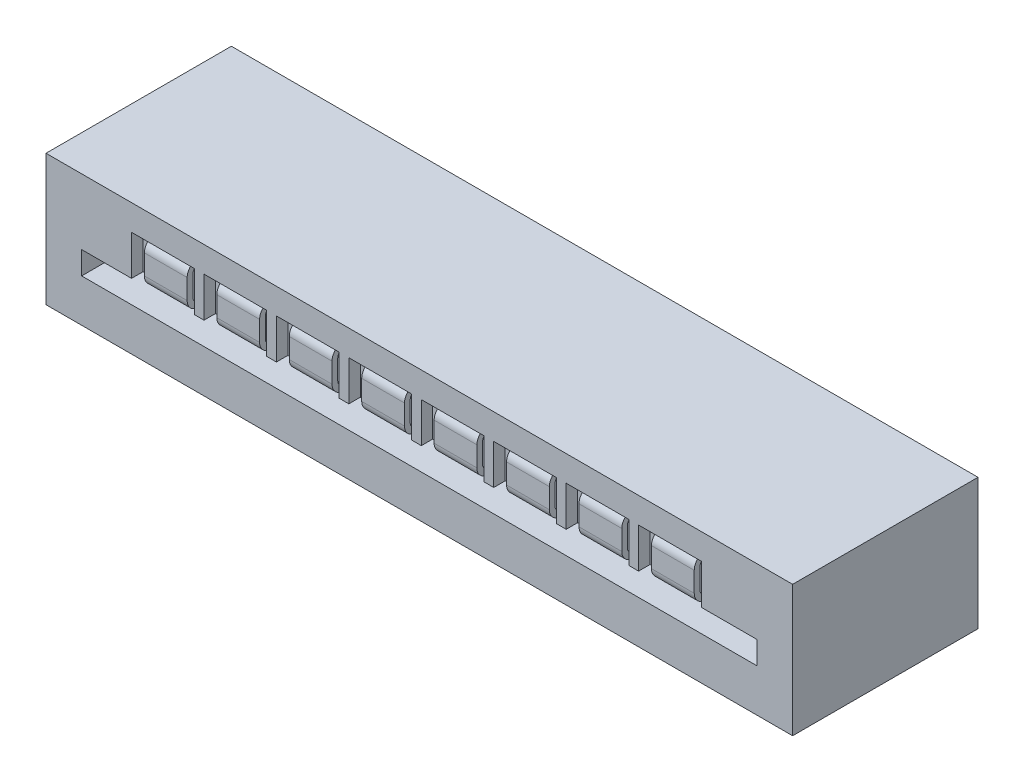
from build123d import *

# Parameters (mm, degrees)
SKETCH_1_W             = 26.18
SKETCH_1_H             = 4.6
EXTRUDE_1_DEPTH        = 6.5
SKETCH_2_W             = 23.68
SKETCH_2_H             = 0.8
CUT_EXTRUDE_2_DEPTH    = 5.5
SKETCH_3_W             = 0.4
SKETCH_3_H             = 1.4
SKETCH_3_W_2           = 0.8
SKETCH_3_H_2           = 3.7
CUT_EXTRUDE_3_DEPTH    = 1.1
EXTRUDE_4_DEPTH        = 0.75
CUT_EXTRUDE_5_DEPTH    = 15.999936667
PATTERN_LINEAR_1_COUNT = 8
PATTERN_LINEAR_1_PITCH = 2.54
PATTERN_LINEAR_2_COUNT = 8
PATTERN_LINEAR_2_PITCH = 2.54


with BuildPart() as part:
    # Sketch 1 → Extrude 1 (new body)
    with BuildSketch(Plane.XY):
        with Locations((0, 2.3)):
            Rectangle(SKETCH_1_W, SKETCH_1_H)
    extrude(amount=-EXTRUDE_1_DEPTH)

    # Sketch 2 → Cut-Extrude 2 (cut)
    with BuildSketch(Plane.XY):
        with Locations((0, 1.9)):
            Rectangle(SKETCH_2_W, SKETCH_2_H)
    extrude(amount=-CUT_EXTRUDE_2_DEPTH, mode=Mode.SUBTRACT)

    # Sketch 3 → Cut-Extrude 3 (cut, symmetric)
    with BuildSketch(Plane.ZY.offset(8.99)):
        with Locations((-0.2, 3)):
            Rectangle(SKETCH_3_W, SKETCH_3_H)
        with Locations((-6.1, 1.85)):
            Rectangle(SKETCH_3_W_2, SKETCH_3_H_2)
    cut_extrude_3 = extrude(amount=CUT_EXTRUDE_3_DEPTH, both=True, mode=Mode.SUBTRACT)

    # Sketch 4 → Extrude 4 (add, symmetric)
    with BuildSketch(Plane.ZY.offset(8.99)):
        with BuildLine():
            Line((-2.1, 2.3), (-0.5, 2.3))
            ThreePointArc((-0.5, 2.3), (-0.358578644, 2.358578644), (-0.3, 2.5))
            Line((-0.3, 2.5), (-0.3, 3.2))
            ThreePointArc((-0.3, 3.2), (-0.358578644, 3.341421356), (-0.5, 3.4))
            Line((-0.5, 3.4), (-5.6, 3.4))
            ThreePointArc((-5.6, 3.4), (-5.741421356, 3.341421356), (-5.8, 3.2))
            Line((-5.8, 3.2), (-5.8, 0.4))
            ThreePointArc((-5.8, 0.4), (-5.917157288, 0.117157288), (-6.2, 0))
            Line((-6.2, 0), (-7.7, 0))
            Line((-7.7, 0), (-7.7, 0.2))
            Line((-7.7, 0.2), (-6.2, 0.2))
            ThreePointArc((-6.2, 0.2), (-6.058578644, 0.258578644), (-6, 0.4))
            Line((-6, 0.4), (-6, 3.2))
            ThreePointArc((-6, 3.2), (-5.882842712, 3.482842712), (-5.6, 3.6))
            Line((-5.6, 3.6), (-0.5, 3.6))
            ThreePointArc((-0.5, 3.6), (-0.217157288, 3.482842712), (-0.1, 3.2))
            Line((-0.1, 3.2), (-0.1, 2.5))
            ThreePointArc((-0.1, 2.5), (-0.217157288, 2.217157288), (-0.5, 2.1))
            Line((-0.5, 2.1), (-2.1, 2.1))
            Line((-2.1, 2.1), (-2.1, 2.3))
        make_face()
    extrude_4 = extrude(amount=EXTRUDE_4_DEPTH, both=True)

    # Sketch 5 → Cut-Extrude 5 (cut, through all)
    with BuildSketch(Plane(origin=(0, 0, -5.7), x_dir=(-1, 0, 0), z_dir=(0, 0, -1))):
        Polygon((8.24, 0), (8.69, 0), (8.69, 1.95), (8.24, 2.4), align=None)
        Polygon((9.29, 0), (9.29, 1.95), (9.74, 2.4), (9.74, 0), align=None)
    cut_extrude_5 = extrude(amount=CUT_EXTRUDE_5_DEPTH, mode=Mode.SUBTRACT)

    # Pattern Linear 1: Cut-Extrude 3 ×8
    with Locations(*[(i * PATTERN_LINEAR_1_PITCH, 0, 0) for i in range(1, PATTERN_LINEAR_1_COUNT)]):
        add(cut_extrude_3, mode=Mode.SUBTRACT)

    # Pattern Linear 2: Extrude 4, Cut-Extrude 5 ×8
    with Locations(*[(i * PATTERN_LINEAR_2_PITCH, 0, 0) for i in range(1, PATTERN_LINEAR_2_COUNT)]):
        add(extrude_4)
        add(cut_extrude_5, mode=Mode.SUBTRACT)


solid = part.part
